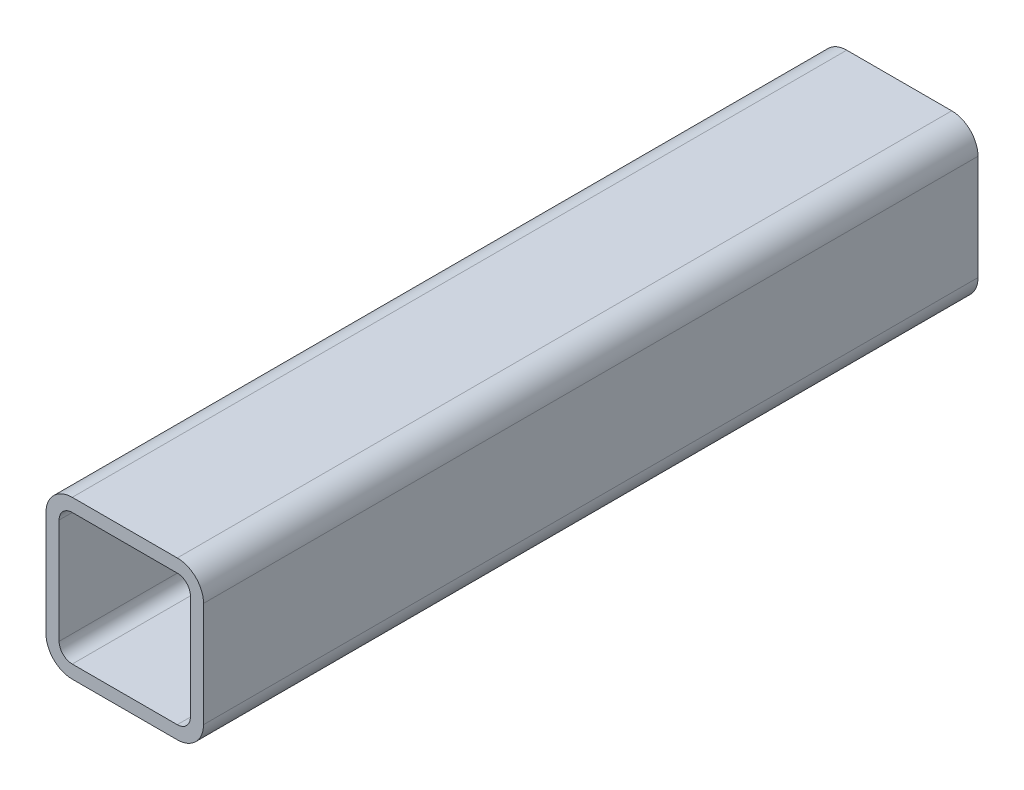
from build123d import *

# Parameters (mm, degrees)
BASE_EXTRUDE_THIN_DEPTH = 374.65


with BuildPart() as part:
    # Sketch1 → Base-Extrude-Thin (new body)
    with BuildSketch(Plane.XY):
        with BuildLine():
            Line((38.1, 25.4), (38.1, -25.4))
            ThreePointArc((38.1, -25.4), (34.380256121, -34.380256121), (25.4, -38.1))
            Line((25.4, -38.1), (-25.4, -38.1))
            ThreePointArc((-25.4, -38.1), (-34.380256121, -34.380256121), (-38.1, -25.4))
            Line((-38.1, -25.4), (-38.1, 25.4))
            ThreePointArc((-38.1, 25.4), (-34.380256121, 34.380256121), (-25.4, 38.1))
            Line((-25.4, 38.1), (25.4, 38.1))
            ThreePointArc((25.4, 38.1), (34.380256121, 34.380256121), (38.1, 25.4))
        make_face()
        with BuildLine():
            Line((31.75, 25.4), (31.75, -25.4))
            ThreePointArc((31.75, -25.4), (29.890128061, -29.890128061), (25.4, -31.75))
            Line((25.4, -31.75), (-25.4, -31.75))
            ThreePointArc((-25.4, -31.75), (-29.890128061, -29.890128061), (-31.75, -25.4))
            Line((-31.75, -25.4), (-31.75, 25.4))
            ThreePointArc((-31.75, 25.4), (-29.890128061, 29.890128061), (-25.4, 31.75))
            Line((-25.4, 31.75), (25.4, 31.75))
            ThreePointArc((25.4, 31.75), (29.890128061, 29.890128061), (31.75, 25.4))
        make_face(mode=Mode.SUBTRACT)
    extrude(amount=BASE_EXTRUDE_THIN_DEPTH)


solid = part.part
